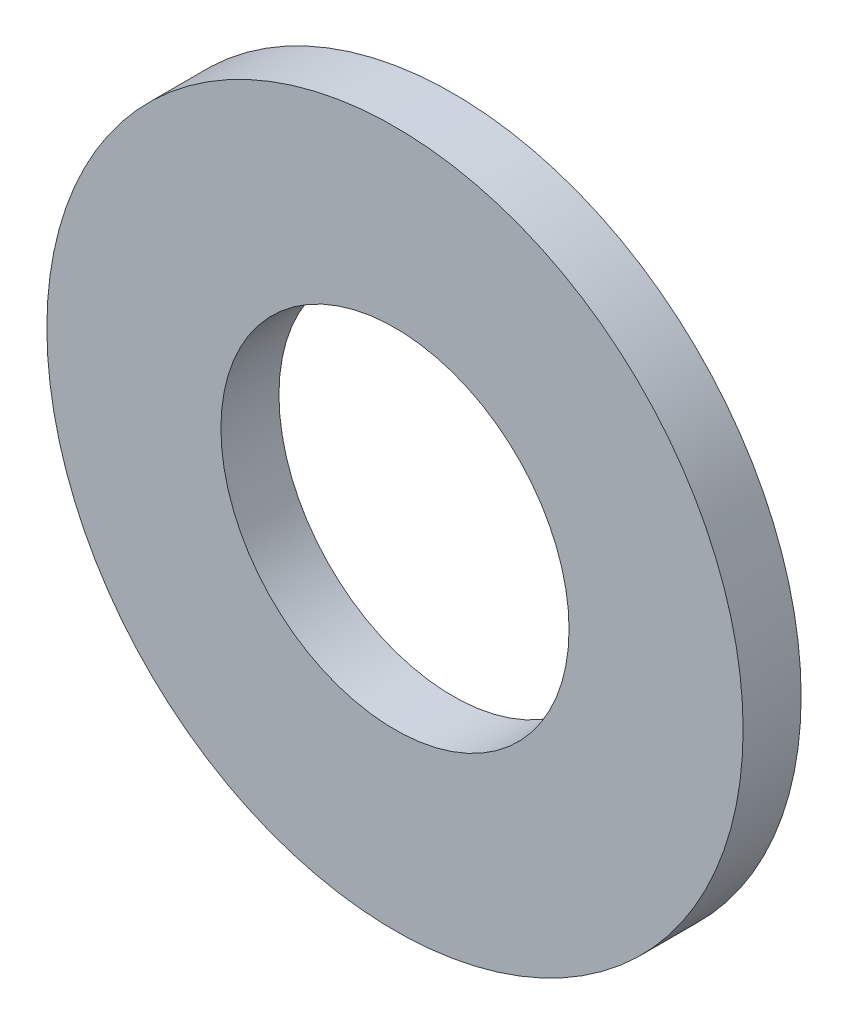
from build123d import *

# Parameters (mm, degrees)
ESQUISSE1_W = 4.5
ESQUISSE1_H = 1.5


with BuildPart() as part:
    # Esquisse1 → R_volution1 (revolve)
    with BuildSketch(Plane(origin=(0, 0, 0), x_dir=(1, 0, 0), z_dir=(0, 1, 0))):
        with Locations((6.75, -0.75)):
            Rectangle(ESQUISSE1_W, ESQUISSE1_H)
    revolve(axis=Axis((0, 0, 0), (0, 0, 1)))


solid = part.part
